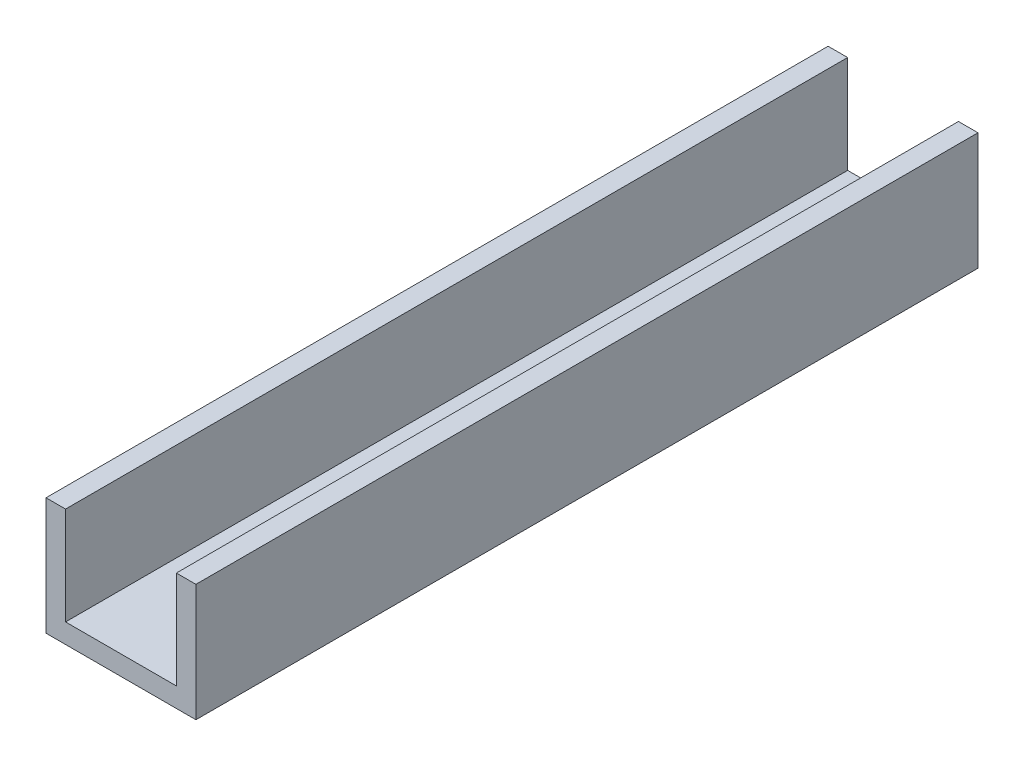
ISO-10303-21;
HEADER;
FILE_DESCRIPTION(('STEP AP214'),'2;1');
FILE_NAME('part.step','',(''),(''),'','','');
FILE_SCHEMA(('AUTOMOTIVE_DESIGN { 1 0 10303 214 1 1 1 1 }'));
ENDSEC;
DATA;
#1=APPLICATION_CONTEXT('core data for automotive mechanical design processes');
#2=APPLICATION_PROTOCOL_DEFINITION('international standard','automotive_design',2000,#1);
#3=PRODUCT_CONTEXT('',#1,'mechanical');
#4=PRODUCT('Part','Part','',(#3));
#5=PRODUCT_RELATED_PRODUCT_CATEGORY('part','',(#4));
#6=PRODUCT_DEFINITION_FORMATION('','',#4);
#7=PRODUCT_DEFINITION_CONTEXT('part definition',#1,'design');
#8=PRODUCT_DEFINITION('design','',#6,#7);
#9=PRODUCT_DEFINITION_SHAPE('','',#8);
#10=(LENGTH_UNIT() NAMED_UNIT(*) SI_UNIT(.MILLI.,.METRE.));
#11=(NAMED_UNIT(*) PLANE_ANGLE_UNIT() SI_UNIT($,.RADIAN.));
#12=(NAMED_UNIT(*) SI_UNIT($,.STERADIAN.) SOLID_ANGLE_UNIT());
#13=UNCERTAINTY_MEASURE_WITH_UNIT(LENGTH_MEASURE(1.E-05),#10,'distance_accuracy_value','');
#14=(GEOMETRIC_REPRESENTATION_CONTEXT(3) GLOBAL_UNCERTAINTY_ASSIGNED_CONTEXT((#13)) GLOBAL_UNIT_ASSIGNED_CONTEXT((#10,
#11,#12)) REPRESENTATION_CONTEXT('',''));
#15=CARTESIAN_POINT('',(0.,0.,0.));
#16=DIRECTION('',(0.,0.,1.));
#17=DIRECTION('',(1.,0.,0.));
#18=AXIS2_PLACEMENT_3D('',#15,#16,#17);
#19=CARTESIAN_POINT('',(8.5,7.5,120.));
#20=DIRECTION('',(1.,0.,0.));
#21=DIRECTION('',(0.,1.,0.));
#22=AXIS2_PLACEMENT_3D('',#19,#20,#21);
#23=PLANE('',#22);
#24=DIRECTION('',(0.,-1.,0.));
#25=VECTOR('',#24,1.);
#26=CARTESIAN_POINT('',(8.5,7.5,0.));
#27=LINE('',#26,#25);
#28=CARTESIAN_POINT('',(8.5,7.5,0.));
#29=VERTEX_POINT('',#28);
#30=CARTESIAN_POINT('',(8.5,-7.5,0.));
#31=VERTEX_POINT('',#30);
#32=EDGE_CURVE('E130',#29,#31,#27,.T.);
#33=ORIENTED_EDGE('',*,*,#32,.T.);
#34=DIRECTION('',(0.,0.,-1.));
#35=VECTOR('',#34,1.);
#36=CARTESIAN_POINT('',(8.5,-7.5,120.));
#37=LINE('',#36,#35);
#38=CARTESIAN_POINT('',(8.5,-7.5,120.));
#39=VERTEX_POINT('',#38);
#40=EDGE_CURVE('E11',#39,#31,#37,.T.);
#41=ORIENTED_EDGE('',*,*,#40,.F.);
#42=DIRECTION('',(0.,-1.,0.));
#43=VECTOR('',#42,1.);
#44=CARTESIAN_POINT('',(8.5,7.5,120.));
#45=LINE('',#44,#43);
#46=CARTESIAN_POINT('',(8.5,7.5,120.));
#47=VERTEX_POINT('',#46);
#48=EDGE_CURVE('E145',#47,#39,#45,.T.);
#49=ORIENTED_EDGE('',*,*,#48,.F.);
#50=DIRECTION('',(0.,0.,-1.));
#51=VECTOR('',#50,1.);
#52=CARTESIAN_POINT('',(8.5,7.5,120.));
#53=LINE('',#52,#51);
#54=EDGE_CURVE('E126',#47,#29,#53,.T.);
#55=ORIENTED_EDGE('',*,*,#54,.T.);
#56=EDGE_LOOP('',(#33,#41,#49,#55));
#57=FACE_BOUND('',#56,.T.);
#58=ADVANCED_FACE('F34',(#57),#23,.F.);
#59=CARTESIAN_POINT('',(-8.5,-7.5,120.));
#60=DIRECTION('',(0.,-1.,0.));
#61=DIRECTION('',(0.,0.,-1.));
#62=AXIS2_PLACEMENT_3D('',#59,#60,#61);
#63=PLANE('',#62);
#64=DIRECTION('',(-1.,0.,0.));
#65=VECTOR('',#64,1.);
#66=CARTESIAN_POINT('',(-8.5,-7.5,0.));
#67=LINE('',#66,#65);
#68=CARTESIAN_POINT('',(-8.5,-7.5,0.));
#69=VERTEX_POINT('',#68);
#70=EDGE_CURVE('E133',#31,#69,#67,.T.);
#71=ORIENTED_EDGE('',*,*,#70,.T.);
#72=DIRECTION('',(0.,0.,-1.));
#73=VECTOR('',#72,1.);
#74=CARTESIAN_POINT('',(-8.5,-7.5,120.));
#75=LINE('',#74,#73);
#76=CARTESIAN_POINT('',(-8.5,-7.5,120.));
#77=VERTEX_POINT('',#76);
#78=EDGE_CURVE('E42',#77,#69,#75,.T.);
#79=ORIENTED_EDGE('',*,*,#78,.F.);
#80=DIRECTION('',(-1.,0.,0.));
#81=VECTOR('',#80,1.);
#82=CARTESIAN_POINT('',(-8.5,-7.5,120.));
#83=LINE('',#82,#81);
#84=EDGE_CURVE('E93',#39,#77,#83,.T.);
#85=ORIENTED_EDGE('',*,*,#84,.F.);
#86=ORIENTED_EDGE('',*,*,#40,.T.);
#87=EDGE_LOOP('',(#71,#79,#85,#86));
#88=FACE_BOUND('',#87,.T.);
#89=ADVANCED_FACE('F218',(#88),#63,.F.);
#90=CARTESIAN_POINT('',(-8.5,7.5,120.));
#91=DIRECTION('',(-1.,0.,0.));
#92=DIRECTION('',(0.,-1.,0.));
#93=AXIS2_PLACEMENT_3D('',#90,#91,#92);
#94=PLANE('',#93);
#95=DIRECTION('',(0.,1.,0.));
#96=VECTOR('',#95,1.);
#97=CARTESIAN_POINT('',(-8.5,7.5,0.));
#98=LINE('',#97,#96);
#99=CARTESIAN_POINT('',(-8.5,7.5,0.));
#100=VERTEX_POINT('',#99);
#101=EDGE_CURVE('E136',#69,#100,#98,.T.);
#102=ORIENTED_EDGE('',*,*,#101,.T.);
#103=DIRECTION('',(0.,0.,-1.));
#104=VECTOR('',#103,1.);
#105=CARTESIAN_POINT('',(-8.5,7.5,120.));
#106=LINE('',#105,#104);
#107=CARTESIAN_POINT('',(-8.5,7.5,120.));
#108=VERTEX_POINT('',#107);
#109=EDGE_CURVE('E152',#108,#100,#106,.T.);
#110=ORIENTED_EDGE('',*,*,#109,.F.);
#111=DIRECTION('',(0.,1.,0.));
#112=VECTOR('',#111,1.);
#113=CARTESIAN_POINT('',(-8.5,7.5,120.));
#114=LINE('',#113,#112);
#115=EDGE_CURVE('E160',#77,#108,#114,.T.);
#116=ORIENTED_EDGE('',*,*,#115,.F.);
#117=ORIENTED_EDGE('',*,*,#78,.T.);
#118=EDGE_LOOP('',(#102,#110,#116,#117));
#119=FACE_BOUND('',#118,.T.);
#120=ADVANCED_FACE('F158',(#119),#94,.F.);
#121=CARTESIAN_POINT('',(-11.5,7.5,120.));
#122=DIRECTION('',(0.,-1.,0.));
#123=DIRECTION('',(1.,0.,0.));
#124=AXIS2_PLACEMENT_3D('',#121,#122,#123);
#125=PLANE('',#124);
#126=DIRECTION('',(-1.,0.,0.));
#127=VECTOR('',#126,1.);
#128=CARTESIAN_POINT('',(-11.5,7.5,0.));
#129=LINE('',#128,#127);
#130=CARTESIAN_POINT('',(-11.5,7.5,0.));
#131=VERTEX_POINT('',#130);
#132=EDGE_CURVE('E138',#100,#131,#129,.T.);
#133=ORIENTED_EDGE('',*,*,#132,.T.);
#134=DIRECTION('',(0.,0.,-1.));
#135=VECTOR('',#134,1.);
#136=CARTESIAN_POINT('',(-11.5,7.5,120.));
#137=LINE('',#136,#135);
#138=CARTESIAN_POINT('',(-11.5,7.5,120.));
#139=VERTEX_POINT('',#138);
#140=EDGE_CURVE('E149',#139,#131,#137,.T.);
#141=ORIENTED_EDGE('',*,*,#140,.F.);
#142=DIRECTION('',(-1.,0.,0.));
#143=VECTOR('',#142,1.);
#144=CARTESIAN_POINT('',(-11.5,7.5,120.));
#145=LINE('',#144,#143);
#146=EDGE_CURVE('E172',#108,#139,#145,.T.);
#147=ORIENTED_EDGE('',*,*,#146,.F.);
#148=ORIENTED_EDGE('',*,*,#109,.T.);
#149=EDGE_LOOP('',(#133,#141,#147,#148));
#150=FACE_BOUND('',#149,.T.);
#151=ADVANCED_FACE('F168',(#150),#125,.F.);
#152=CARTESIAN_POINT('',(-11.5,7.5,120.));
#153=DIRECTION('',(1.,0.,0.));
#154=DIRECTION('',(0.,1.,0.));
#155=AXIS2_PLACEMENT_3D('',#152,#153,#154);
#156=PLANE('',#155);
#157=DIRECTION('',(0.,-1.,0.));
#158=VECTOR('',#157,1.);
#159=CARTESIAN_POINT('',(-11.5,7.5,0.));
#160=LINE('',#159,#158);
#161=CARTESIAN_POINT('',(-11.5,-10.5,0.));
#162=VERTEX_POINT('',#161);
#163=EDGE_CURVE('E140',#131,#162,#160,.T.);
#164=ORIENTED_EDGE('',*,*,#163,.T.);
#165=DIRECTION('',(0.,0.,-1.));
#166=VECTOR('',#165,1.);
#167=CARTESIAN_POINT('',(-11.5,-10.5,120.));
#168=LINE('',#167,#166);
#169=CARTESIAN_POINT('',(-11.5,-10.5,120.));
#170=VERTEX_POINT('',#169);
#171=EDGE_CURVE('E121',#170,#162,#168,.T.);
#172=ORIENTED_EDGE('',*,*,#171,.F.);
#173=DIRECTION('',(0.,-1.,0.));
#174=VECTOR('',#173,1.);
#175=CARTESIAN_POINT('',(-11.5,7.5,120.));
#176=LINE('',#175,#174);
#177=EDGE_CURVE('E112',#139,#170,#176,.T.);
#178=ORIENTED_EDGE('',*,*,#177,.F.);
#179=ORIENTED_EDGE('',*,*,#140,.T.);
#180=EDGE_LOOP('',(#164,#172,#178,#179));
#181=FACE_BOUND('',#180,.T.);
#182=ADVANCED_FACE('F171',(#181),#156,.F.);
#183=CARTESIAN_POINT('',(-11.5,-10.5,120.));
#184=DIRECTION('',(0.,1.,0.));
#185=DIRECTION('',(-1.,0.,0.));
#186=AXIS2_PLACEMENT_3D('',#183,#184,#185);
#187=PLANE('',#186);
#188=CARTESIAN_POINT('',(0.,-10.5,35.));
#189=DIRECTION('',(0.,-1.,0.));
#190=DIRECTION('',(1.,0.,0.));
#191=AXIS2_PLACEMENT_3D('',#188,#189,#190);
#192=CIRCLE('',#191,1.5);
#193=CARTESIAN_POINT('',(1.5,-10.5,35.));
#194=VERTEX_POINT('',#193);
#195=EDGE_CURVE('E184',#194,#194,#192,.T.);
#196=ORIENTED_EDGE('',*,*,#195,.F.);
#197=EDGE_LOOP('',(#196));
#198=FACE_BOUND('',#197,.T.);
#199=CARTESIAN_POINT('',(0.,-10.5,20.));
#200=DIRECTION('',(0.,-1.,0.));
#201=DIRECTION('',(1.,0.,0.));
#202=AXIS2_PLACEMENT_3D('',#199,#200,#201);
#203=CIRCLE('',#202,1.5);
#204=CARTESIAN_POINT('',(1.5,-10.5,20.));
#205=VERTEX_POINT('',#204);
#206=EDGE_CURVE('E178',#205,#205,#203,.T.);
#207=ORIENTED_EDGE('',*,*,#206,.F.);
#208=EDGE_LOOP('',(#207));
#209=FACE_BOUND('',#208,.T.);
#210=DIRECTION('',(1.,0.,0.));
#211=VECTOR('',#210,1.);
#212=CARTESIAN_POINT('',(-11.5,-10.5,0.));
#213=LINE('',#212,#211);
#214=CARTESIAN_POINT('',(11.5,-10.5,0.));
#215=VERTEX_POINT('',#214);
#216=EDGE_CURVE('E120',#162,#215,#213,.T.);
#217=ORIENTED_EDGE('',*,*,#216,.T.);
#218=DIRECTION('',(0.,0.,-1.));
#219=VECTOR('',#218,1.);
#220=CARTESIAN_POINT('',(11.5,-10.5,120.));
#221=LINE('',#220,#219);
#222=CARTESIAN_POINT('',(11.5,-10.5,120.));
#223=VERTEX_POINT('',#222);
#224=EDGE_CURVE('E117',#223,#215,#221,.T.);
#225=ORIENTED_EDGE('',*,*,#224,.F.);
#226=DIRECTION('',(1.,0.,0.));
#227=VECTOR('',#226,1.);
#228=CARTESIAN_POINT('',(-11.5,-10.5,120.));
#229=LINE('',#228,#227);
#230=EDGE_CURVE('E106',#170,#223,#229,.T.);
#231=ORIENTED_EDGE('',*,*,#230,.F.);
#232=ORIENTED_EDGE('',*,*,#171,.T.);
#233=EDGE_LOOP('',(#217,#225,#231,#232));
#234=FACE_BOUND('',#233,.T.);
#235=ADVANCED_FACE('F118',(#198,#209,#234),#187,.F.);
#236=CARTESIAN_POINT('',(11.5,7.5,120.));
#237=DIRECTION('',(-1.,0.,0.));
#238=DIRECTION('',(0.,-1.,0.));
#239=AXIS2_PLACEMENT_3D('',#236,#237,#238);
#240=PLANE('',#239);
#241=DIRECTION('',(0.,1.,0.));
#242=VECTOR('',#241,1.);
#243=CARTESIAN_POINT('',(11.5,7.5,0.));
#244=LINE('',#243,#242);
#245=CARTESIAN_POINT('',(11.5,7.5,0.));
#246=VERTEX_POINT('',#245);
#247=EDGE_CURVE('E79',#215,#246,#244,.T.);
#248=ORIENTED_EDGE('',*,*,#247,.T.);
#249=DIRECTION('',(0.,0.,-1.));
#250=VECTOR('',#249,1.);
#251=CARTESIAN_POINT('',(11.5,7.5,120.));
#252=LINE('',#251,#250);
#253=CARTESIAN_POINT('',(11.5,7.5,120.));
#254=VERTEX_POINT('',#253);
#255=EDGE_CURVE('E122',#254,#246,#252,.T.);
#256=ORIENTED_EDGE('',*,*,#255,.F.);
#257=DIRECTION('',(0.,1.,0.));
#258=VECTOR('',#257,1.);
#259=CARTESIAN_POINT('',(11.5,7.5,120.));
#260=LINE('',#259,#258);
#261=EDGE_CURVE('E110',#223,#254,#260,.T.);
#262=ORIENTED_EDGE('',*,*,#261,.F.);
#263=ORIENTED_EDGE('',*,*,#224,.T.);
#264=EDGE_LOOP('',(#248,#256,#262,#263));
#265=FACE_BOUND('',#264,.T.);
#266=ADVANCED_FACE('F124',(#265),#240,.F.);
#267=CARTESIAN_POINT('',(8.5,7.5,120.));
#268=DIRECTION('',(0.,-1.,0.));
#269=DIRECTION('',(0.,0.,-1.));
#270=AXIS2_PLACEMENT_3D('',#267,#268,#269);
#271=PLANE('',#270);
#272=DIRECTION('',(-1.,0.,0.));
#273=VECTOR('',#272,1.);
#274=CARTESIAN_POINT('',(8.5,7.5,0.));
#275=LINE('',#274,#273);
#276=EDGE_CURVE('E85',#246,#29,#275,.T.);
#277=ORIENTED_EDGE('',*,*,#276,.T.);
#278=ORIENTED_EDGE('',*,*,#54,.F.);
#279=DIRECTION('',(-1.,0.,0.));
#280=VECTOR('',#279,1.);
#281=CARTESIAN_POINT('',(8.5,7.5,120.));
#282=LINE('',#281,#280);
#283=EDGE_CURVE('E50',#254,#47,#282,.T.);
#284=ORIENTED_EDGE('',*,*,#283,.F.);
#285=ORIENTED_EDGE('',*,*,#255,.T.);
#286=EDGE_LOOP('',(#277,#278,#284,#285));
#287=FACE_BOUND('',#286,.T.);
#288=ADVANCED_FACE('F225',(#287),#271,.F.);
#289=CARTESIAN_POINT('',(0.,0.,120.));
#290=DIRECTION('',(0.,0.,1.));
#291=DIRECTION('',(1.,0.,0.));
#292=AXIS2_PLACEMENT_3D('',#289,#290,#291);
#293=PLANE('',#292);
#294=ORIENTED_EDGE('',*,*,#48,.T.);
#295=ORIENTED_EDGE('',*,*,#84,.T.);
#296=ORIENTED_EDGE('',*,*,#115,.T.);
#297=ORIENTED_EDGE('',*,*,#146,.T.);
#298=ORIENTED_EDGE('',*,*,#177,.T.);
#299=ORIENTED_EDGE('',*,*,#230,.T.);
#300=ORIENTED_EDGE('',*,*,#261,.T.);
#301=ORIENTED_EDGE('',*,*,#283,.T.);
#302=EDGE_LOOP('',(#294,#295,#296,#297,#298,#299,#300,#301));
#303=FACE_BOUND('',#302,.T.);
#304=ADVANCED_FACE('F108',(#303),#293,.T.);
#305=CARTESIAN_POINT('',(0.,0.,0.));
#306=DIRECTION('',(0.,0.,1.));
#307=DIRECTION('',(1.,0.,0.));
#308=AXIS2_PLACEMENT_3D('',#305,#306,#307);
#309=PLANE('',#308);
#310=ORIENTED_EDGE('',*,*,#32,.F.);
#311=ORIENTED_EDGE('',*,*,#276,.F.);
#312=ORIENTED_EDGE('',*,*,#247,.F.);
#313=ORIENTED_EDGE('',*,*,#216,.F.);
#314=ORIENTED_EDGE('',*,*,#163,.F.);
#315=ORIENTED_EDGE('',*,*,#132,.F.);
#316=ORIENTED_EDGE('',*,*,#101,.F.);
#317=ORIENTED_EDGE('',*,*,#70,.F.);
#318=EDGE_LOOP('',(#310,#311,#312,#313,#314,#315,#316,#317));
#319=FACE_BOUND('',#318,.T.);
#320=ADVANCED_FACE('F164',(#319),#309,.F.);
#321=CARTESIAN_POINT('',(0.,-9.5,20.));
#322=DIRECTION('',(0.,-1.,0.));
#323=DIRECTION('',(1.,0.,0.));
#324=AXIS2_PLACEMENT_3D('',#321,#322,#323);
#325=CYLINDRICAL_SURFACE('',#324,1.5);
#326=CARTESIAN_POINT('',(0.,-9.5,20.));
#327=DIRECTION('',(0.,-1.,0.));
#328=DIRECTION('',(1.,0.,0.));
#329=AXIS2_PLACEMENT_3D('',#326,#327,#328);
#330=CIRCLE('',#329,1.5);
#331=CARTESIAN_POINT('',(1.5,-9.5,20.));
#332=VERTEX_POINT('',#331);
#333=EDGE_CURVE('E134',#332,#332,#330,.T.);
#334=ORIENTED_EDGE('',*,*,#333,.F.);
#335=EDGE_LOOP('',(#334));
#336=FACE_BOUND('',#335,.T.);
#337=ORIENTED_EDGE('',*,*,#206,.T.);
#338=EDGE_LOOP('',(#337));
#339=FACE_BOUND('',#338,.T.);
#340=ADVANCED_FACE('F204',(#336,#339),#325,.F.);
#341=CARTESIAN_POINT('',(0.,-9.5,20.));
#342=DIRECTION('',(0.,-1.,0.));
#343=DIRECTION('',(1.,0.,0.));
#344=AXIS2_PLACEMENT_3D('',#341,#342,#343);
#345=PLANE('',#344);
#346=ORIENTED_EDGE('',*,*,#333,.T.);
#347=EDGE_LOOP('',(#346));
#348=FACE_BOUND('',#347,.T.);
#349=ADVANCED_FACE('F195',(#348),#345,.T.);
#350=CARTESIAN_POINT('',(0.,-9.5,35.));
#351=DIRECTION('',(0.,-1.,0.));
#352=DIRECTION('',(1.,0.,0.));
#353=AXIS2_PLACEMENT_3D('',#350,#351,#352);
#354=CYLINDRICAL_SURFACE('',#353,1.5);
#355=CARTESIAN_POINT('',(0.,-9.5,35.));
#356=DIRECTION('',(0.,-1.,0.));
#357=DIRECTION('',(1.,0.,0.));
#358=AXIS2_PLACEMENT_3D('',#355,#356,#357);
#359=CIRCLE('',#358,1.5);
#360=CARTESIAN_POINT('',(1.5,-9.5,35.));
#361=VERTEX_POINT('',#360);
#362=EDGE_CURVE('E181',#361,#361,#359,.T.);
#363=ORIENTED_EDGE('',*,*,#362,.F.);
#364=EDGE_LOOP('',(#363));
#365=FACE_BOUND('',#364,.T.);
#366=ORIENTED_EDGE('',*,*,#195,.T.);
#367=EDGE_LOOP('',(#366));
#368=FACE_BOUND('',#367,.T.);
#369=ADVANCED_FACE('F192',(#365,#368),#354,.F.);
#370=CARTESIAN_POINT('',(0.,-9.5,35.));
#371=DIRECTION('',(0.,-1.,0.));
#372=DIRECTION('',(1.,0.,0.));
#373=AXIS2_PLACEMENT_3D('',#370,#371,#372);
#374=PLANE('',#373);
#375=ORIENTED_EDGE('',*,*,#362,.T.);
#376=EDGE_LOOP('',(#375));
#377=FACE_BOUND('',#376,.T.);
#378=ADVANCED_FACE('F190',(#377),#374,.T.);
#379=CLOSED_SHELL('',(#58,#89,#120,#151,#182,#235,#266,#288,#304,#320,#340,#349,#369,#378));
#380=MANIFOLD_SOLID_BREP('B2',#379);
#381=ADVANCED_BREP_SHAPE_REPRESENTATION('',(#18,#380),#14);
#382=SHAPE_DEFINITION_REPRESENTATION(#9,#381);
ENDSEC;
END-ISO-10303-21;
